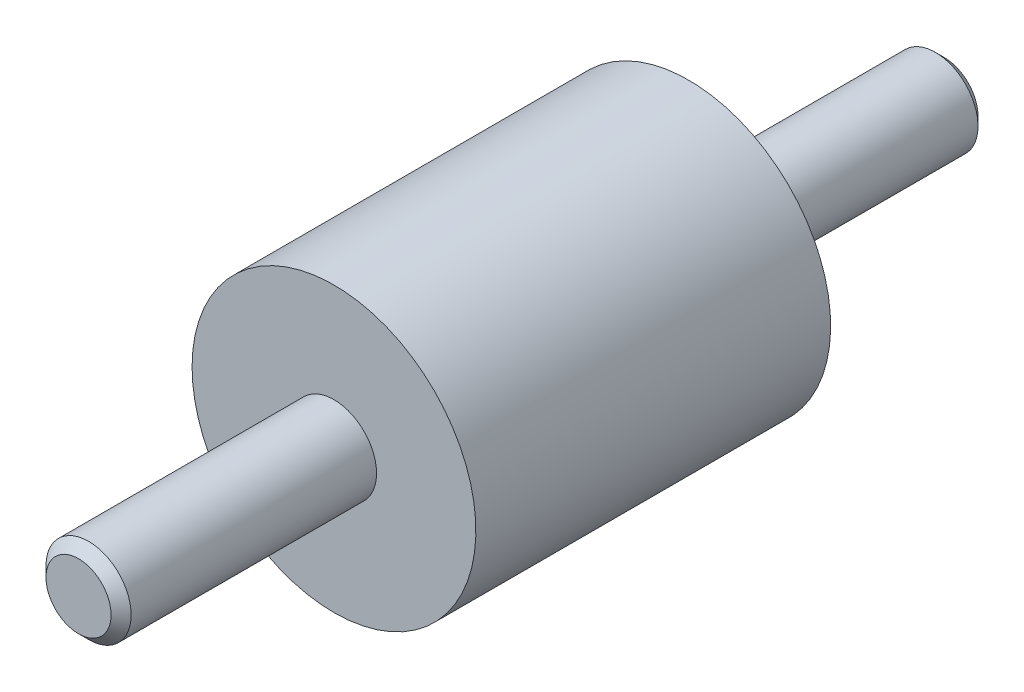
ISO-10303-21;
HEADER;
FILE_DESCRIPTION(('STEP AP214'),'2;1');
FILE_NAME('part.step','',(''),(''),'','','');
FILE_SCHEMA(('AUTOMOTIVE_DESIGN { 1 0 10303 214 1 1 1 1 }'));
ENDSEC;
DATA;
#1=APPLICATION_CONTEXT('core data for automotive mechanical design processes');
#2=APPLICATION_PROTOCOL_DEFINITION('international standard','automotive_design',2000,#1);
#3=PRODUCT_CONTEXT('',#1,'mechanical');
#4=PRODUCT('Part','Part','',(#3));
#5=PRODUCT_RELATED_PRODUCT_CATEGORY('part','',(#4));
#6=PRODUCT_DEFINITION_FORMATION('','',#4);
#7=PRODUCT_DEFINITION_CONTEXT('part definition',#1,'design');
#8=PRODUCT_DEFINITION('design','',#6,#7);
#9=PRODUCT_DEFINITION_SHAPE('','',#8);
#10=(LENGTH_UNIT() NAMED_UNIT(*) SI_UNIT(.MILLI.,.METRE.));
#11=(NAMED_UNIT(*) PLANE_ANGLE_UNIT() SI_UNIT($,.RADIAN.));
#12=(NAMED_UNIT(*) SI_UNIT($,.STERADIAN.) SOLID_ANGLE_UNIT());
#13=UNCERTAINTY_MEASURE_WITH_UNIT(LENGTH_MEASURE(1.E-05),#10,'distance_accuracy_value','');
#14=(GEOMETRIC_REPRESENTATION_CONTEXT(3) GLOBAL_UNCERTAINTY_ASSIGNED_CONTEXT((#13)) GLOBAL_UNIT_ASSIGNED_CONTEXT((#10,
#11,#12)) REPRESENTATION_CONTEXT('',''));
#15=CARTESIAN_POINT('',(0.,0.,0.));
#16=DIRECTION('',(0.,0.,1.));
#17=DIRECTION('',(1.,0.,0.));
#18=AXIS2_PLACEMENT_3D('',#15,#16,#17);
#19=CARTESIAN_POINT('',(0.,0.,0.5));
#20=DIRECTION('',(0.,0.,1.));
#21=DIRECTION('',(0.,-1.,0.));
#22=AXIS2_PLACEMENT_3D('',#19,#20,#21);
#23=CYLINDRICAL_SURFACE('',#22,10.);
#24=CARTESIAN_POINT('',(0.,0.,0.));
#25=DIRECTION('',(0.,0.,1.));
#26=DIRECTION('',(0.,-1.,0.));
#27=AXIS2_PLACEMENT_3D('',#24,#25,#26);
#28=CIRCLE('',#27,10.);
#29=CARTESIAN_POINT('',(0.,-10.,0.));
#30=VERTEX_POINT('',#29);
#31=EDGE_CURVE('E22',#30,#30,#28,.T.);
#32=ORIENTED_EDGE('',*,*,#31,.T.);
#33=EDGE_LOOP('',(#32));
#34=FACE_BOUND('',#33,.T.);
#35=CARTESIAN_POINT('',(0.,0.,25.));
#36=DIRECTION('',(0.,0.,-1.));
#37=DIRECTION('',(-1.,0.,0.));
#38=AXIS2_PLACEMENT_3D('',#35,#36,#37);
#39=CIRCLE('',#38,10.);
#40=CARTESIAN_POINT('',(-10.,0.,25.));
#41=VERTEX_POINT('',#40);
#42=EDGE_CURVE('E34',#41,#41,#39,.T.);
#43=ORIENTED_EDGE('',*,*,#42,.T.);
#44=EDGE_LOOP('',(#43));
#45=FACE_BOUND('',#44,.T.);
#46=ADVANCED_FACE('F12',(#34,#45),#23,.T.);
#47=CARTESIAN_POINT('',(10.,0.,0.));
#48=DIRECTION('',(0.,0.,-1.));
#49=DIRECTION('',(0.,1.,0.));
#50=AXIS2_PLACEMENT_3D('',#47,#48,#49);
#51=PLANE('',#50);
#52=CARTESIAN_POINT('',(0.,0.,0.));
#53=DIRECTION('',(0.,0.,-1.));
#54=DIRECTION('',(0.,1.,0.));
#55=AXIS2_PLACEMENT_3D('',#52,#53,#54);
#56=CIRCLE('',#55,3.);
#57=CARTESIAN_POINT('',(0.,3.,0.));
#58=VERTEX_POINT('',#57);
#59=EDGE_CURVE('E18',#58,#58,#56,.T.);
#60=ORIENTED_EDGE('',*,*,#59,.F.);
#61=EDGE_LOOP('',(#60));
#62=FACE_BOUND('',#61,.T.);
#63=ORIENTED_EDGE('',*,*,#31,.F.);
#64=EDGE_LOOP('',(#63));
#65=FACE_BOUND('',#64,.T.);
#66=ADVANCED_FACE('F57',(#62,#65),#51,.T.);
#67=CARTESIAN_POINT('',(0.,0.,-18.));
#68=DIRECTION('',(0.,0.,1.));
#69=DIRECTION('',(0.,-1.,0.));
#70=AXIS2_PLACEMENT_3D('',#67,#68,#69);
#71=CYLINDRICAL_SURFACE('',#70,3.);
#72=CARTESIAN_POINT('',(0.,0.,-17.3865));
#73=DIRECTION('',(0.,0.,1.));
#74=DIRECTION('',(0.,-1.,0.));
#75=AXIS2_PLACEMENT_3D('',#72,#73,#74);
#76=CIRCLE('',#75,3.);
#77=CARTESIAN_POINT('',(0.,-3.,-17.3865));
#78=VERTEX_POINT('',#77);
#79=EDGE_CURVE('E26',#78,#78,#76,.T.);
#80=ORIENTED_EDGE('',*,*,#79,.T.);
#81=EDGE_LOOP('',(#80));
#82=FACE_BOUND('',#81,.T.);
#83=ORIENTED_EDGE('',*,*,#59,.T.);
#84=EDGE_LOOP('',(#83));
#85=FACE_BOUND('',#84,.T.);
#86=ADVANCED_FACE('F62',(#82,#85),#71,.T.);
#87=CARTESIAN_POINT('',(0.,0.,-17.3865));
#88=DIRECTION('',(0.,0.,1.));
#89=DIRECTION('',(0.,-1.,0.));
#90=AXIS2_PLACEMENT_3D('',#87,#88,#89);
#91=CONICAL_SURFACE('',#90,3.,0.785398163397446);
#92=CARTESIAN_POINT('',(0.,0.,-18.));
#93=DIRECTION('',(0.,0.,1.));
#94=DIRECTION('',(0.,-1.,0.));
#95=AXIS2_PLACEMENT_3D('',#92,#93,#94);
#96=CIRCLE('',#95,2.3865);
#97=CARTESIAN_POINT('',(0.,-2.3865,-18.));
#98=VERTEX_POINT('',#97);
#99=EDGE_CURVE('E31',#98,#98,#96,.T.);
#100=ORIENTED_EDGE('',*,*,#99,.T.);
#101=EDGE_LOOP('',(#100));
#102=FACE_BOUND('',#101,.T.);
#103=ORIENTED_EDGE('',*,*,#79,.F.);
#104=EDGE_LOOP('',(#103));
#105=FACE_BOUND('',#104,.T.);
#106=ADVANCED_FACE('F78',(#102,#105),#91,.T.);
#107=CARTESIAN_POINT('',(2.3865,0.,-18.));
#108=DIRECTION('',(0.,0.,-1.));
#109=DIRECTION('',(0.,1.,0.));
#110=AXIS2_PLACEMENT_3D('',#107,#108,#109);
#111=PLANE('',#110);
#112=ORIENTED_EDGE('',*,*,#99,.F.);
#113=EDGE_LOOP('',(#112));
#114=FACE_BOUND('',#113,.T.);
#115=ADVANCED_FACE('F70',(#114),#111,.T.);
#116=CARTESIAN_POINT('',(0.,10.,25.));
#117=DIRECTION('',(0.,0.,1.));
#118=DIRECTION('',(1.,0.,0.));
#119=AXIS2_PLACEMENT_3D('',#116,#117,#118);
#120=PLANE('',#119);
#121=CARTESIAN_POINT('',(0.,0.,25.));
#122=DIRECTION('',(0.,0.,1.));
#123=DIRECTION('',(1.,0.,0.));
#124=AXIS2_PLACEMENT_3D('',#121,#122,#123);
#125=CIRCLE('',#124,3.);
#126=CARTESIAN_POINT('',(3.,0.,25.));
#127=VERTEX_POINT('',#126);
#128=EDGE_CURVE('E8',#127,#127,#125,.F.);
#129=ORIENTED_EDGE('',*,*,#128,.T.);
#130=EDGE_LOOP('',(#129));
#131=FACE_BOUND('',#130,.T.);
#132=ORIENTED_EDGE('',*,*,#42,.F.);
#133=EDGE_LOOP('',(#132));
#134=FACE_BOUND('',#133,.T.);
#135=ADVANCED_FACE('F68',(#131,#134),#120,.T.);
#136=CARTESIAN_POINT('',(0.,0.,15.));
#137=DIRECTION('',(0.,0.,1.));
#138=DIRECTION('',(0.,-1.,0.));
#139=AXIS2_PLACEMENT_3D('',#136,#137,#138);
#140=CYLINDRICAL_SURFACE('',#139,3.);
#141=ORIENTED_EDGE('',*,*,#128,.F.);
#142=EDGE_LOOP('',(#141));
#143=FACE_BOUND('',#142,.T.);
#144=CARTESIAN_POINT('',(0.,0.,42.2938023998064));
#145=DIRECTION('',(0.,0.,-1.));
#146=DIRECTION('',(-1.,0.,0.));
#147=AXIS2_PLACEMENT_3D('',#144,#145,#146);
#148=CIRCLE('',#147,3.);
#149=CARTESIAN_POINT('',(-3.,0.,42.2938023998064));
#150=VERTEX_POINT('',#149);
#151=EDGE_CURVE('E37',#150,#150,#148,.T.);
#152=ORIENTED_EDGE('',*,*,#151,.T.);
#153=EDGE_LOOP('',(#152));
#154=FACE_BOUND('',#153,.T.);
#155=ADVANCED_FACE('F54',(#143,#154),#140,.T.);
#156=CARTESIAN_POINT('',(0.,0.,42.2938023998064));
#157=DIRECTION('',(0.,0.,-1.));
#158=DIRECTION('',(-1.,0.,0.));
#159=AXIS2_PLACEMENT_3D('',#156,#157,#158);
#160=CONICAL_SURFACE('',#159,3.,0.785398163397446);
#161=CARTESIAN_POINT('',(0.,0.,43.));
#162=DIRECTION('',(0.,0.,-1.));
#163=DIRECTION('',(-1.,0.,0.));
#164=AXIS2_PLACEMENT_3D('',#161,#162,#163);
#165=CIRCLE('',#164,2.29380239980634);
#166=CARTESIAN_POINT('',(-2.29380239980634,0.,43.));
#167=VERTEX_POINT('',#166);
#168=EDGE_CURVE('E40',#167,#167,#165,.T.);
#169=ORIENTED_EDGE('',*,*,#168,.T.);
#170=EDGE_LOOP('',(#169));
#171=FACE_BOUND('',#170,.T.);
#172=ORIENTED_EDGE('',*,*,#151,.F.);
#173=EDGE_LOOP('',(#172));
#174=FACE_BOUND('',#173,.T.);
#175=ADVANCED_FACE('F44',(#171,#174),#160,.T.);
#176=CARTESIAN_POINT('',(0.,2.29380239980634,43.));
#177=DIRECTION('',(0.,0.,1.));
#178=DIRECTION('',(1.,0.,0.));
#179=AXIS2_PLACEMENT_3D('',#176,#177,#178);
#180=PLANE('',#179);
#181=ORIENTED_EDGE('',*,*,#168,.F.);
#182=EDGE_LOOP('',(#181));
#183=FACE_BOUND('',#182,.T.);
#184=ADVANCED_FACE('F47',(#183),#180,.T.);
#185=CLOSED_SHELL('',(#46,#66,#86,#106,#115,#135,#155,#175,#184));
#186=MANIFOLD_SOLID_BREP('B1',#185);
#187=ADVANCED_BREP_SHAPE_REPRESENTATION('',(#18,#186),#14);
#188=SHAPE_DEFINITION_REPRESENTATION(#9,#187);
ENDSEC;
END-ISO-10303-21;
